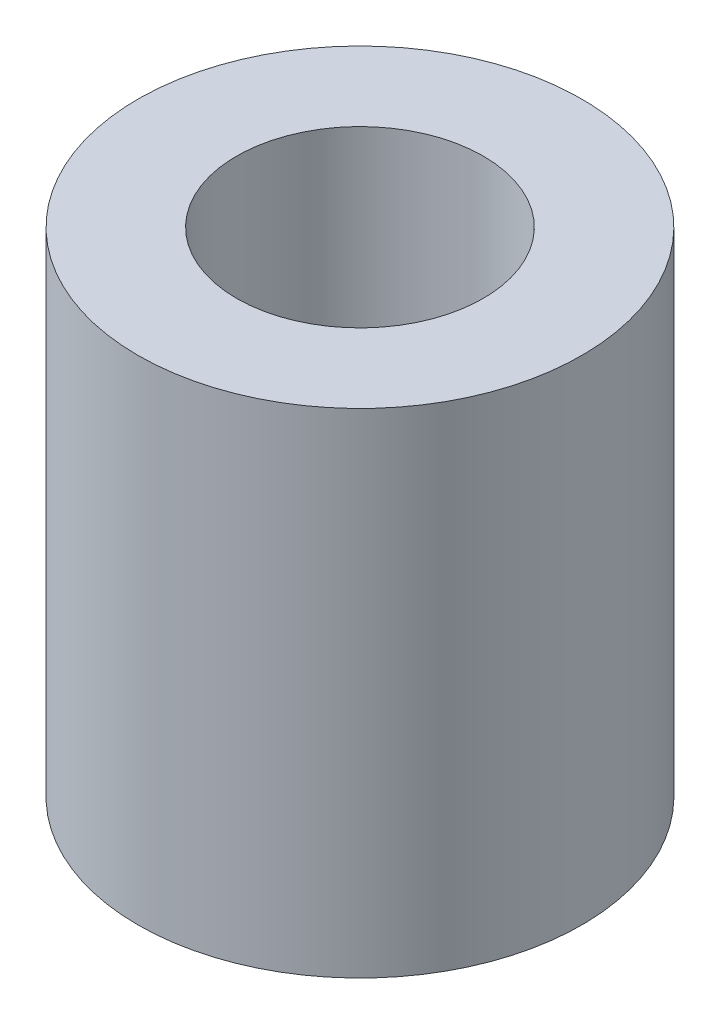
ISO-10303-21;
HEADER;
FILE_DESCRIPTION(('STEP AP214'),'2;1');
FILE_NAME('part.step','',(''),(''),'','','');
FILE_SCHEMA(('AUTOMOTIVE_DESIGN { 1 0 10303 214 1 1 1 1 }'));
ENDSEC;
DATA;
#1=APPLICATION_CONTEXT('core data for automotive mechanical design processes');
#2=APPLICATION_PROTOCOL_DEFINITION('international standard','automotive_design',2000,#1);
#3=PRODUCT_CONTEXT('',#1,'mechanical');
#4=PRODUCT('Part','Part','',(#3));
#5=PRODUCT_RELATED_PRODUCT_CATEGORY('part','',(#4));
#6=PRODUCT_DEFINITION_FORMATION('','',#4);
#7=PRODUCT_DEFINITION_CONTEXT('part definition',#1,'design');
#8=PRODUCT_DEFINITION('design','',#6,#7);
#9=PRODUCT_DEFINITION_SHAPE('','',#8);
#10=(LENGTH_UNIT() NAMED_UNIT(*) SI_UNIT(.MILLI.,.METRE.));
#11=(NAMED_UNIT(*) PLANE_ANGLE_UNIT() SI_UNIT($,.RADIAN.));
#12=(NAMED_UNIT(*) SI_UNIT($,.STERADIAN.) SOLID_ANGLE_UNIT());
#13=UNCERTAINTY_MEASURE_WITH_UNIT(LENGTH_MEASURE(1.E-05),#10,'distance_accuracy_value','');
#14=(GEOMETRIC_REPRESENTATION_CONTEXT(3) GLOBAL_UNCERTAINTY_ASSIGNED_CONTEXT((#13)) GLOBAL_UNIT_ASSIGNED_CONTEXT((#10,
#11,#12)) REPRESENTATION_CONTEXT('',''));
#15=CARTESIAN_POINT('',(0.,0.,0.));
#16=DIRECTION('',(0.,0.,1.));
#17=DIRECTION('',(1.,0.,0.));
#18=AXIS2_PLACEMENT_3D('',#15,#16,#17);
#19=CARTESIAN_POINT('',(0.,5.,0.));
#20=DIRECTION('',(0.,1.,0.));
#21=DIRECTION('',(0.,0.,1.));
#22=AXIS2_PLACEMENT_3D('',#19,#20,#21);
#23=PLANE('',#22);
#24=CARTESIAN_POINT('',(0.,5.,0.));
#25=DIRECTION('',(0.,1.,0.));
#26=DIRECTION('',(0.,0.,1.));
#27=AXIS2_PLACEMENT_3D('',#24,#25,#26);
#28=CIRCLE('',#27,4.5);
#29=CARTESIAN_POINT('',(0.,5.,4.5));
#30=VERTEX_POINT('',#29);
#31=EDGE_CURVE('E10',#30,#30,#28,.T.);
#32=ORIENTED_EDGE('',*,*,#31,.T.);
#33=EDGE_LOOP('',(#32));
#34=FACE_BOUND('',#33,.T.);
#35=CARTESIAN_POINT('',(0.,5.,0.));
#36=DIRECTION('',(0.,1.,0.));
#37=DIRECTION('',(0.,0.,1.));
#38=AXIS2_PLACEMENT_3D('',#35,#36,#37);
#39=CIRCLE('',#38,2.5);
#40=CARTESIAN_POINT('',(0.,5.,2.5));
#41=VERTEX_POINT('',#40);
#42=EDGE_CURVE('E45',#41,#41,#39,.T.);
#43=ORIENTED_EDGE('',*,*,#42,.F.);
#44=EDGE_LOOP('',(#43));
#45=FACE_BOUND('',#44,.T.);
#46=ADVANCED_FACE('F34',(#34,#45),#23,.T.);
#47=CARTESIAN_POINT('',(0.,-5.,0.));
#48=DIRECTION('',(0.,1.,0.));
#49=DIRECTION('',(0.,0.,1.));
#50=AXIS2_PLACEMENT_3D('',#47,#48,#49);
#51=PLANE('',#50);
#52=CARTESIAN_POINT('',(0.,-5.,0.));
#53=DIRECTION('',(0.,1.,0.));
#54=DIRECTION('',(0.,0.,1.));
#55=AXIS2_PLACEMENT_3D('',#52,#53,#54);
#56=CIRCLE('',#55,4.5);
#57=CARTESIAN_POINT('',(0.,-5.,4.5));
#58=VERTEX_POINT('',#57);
#59=EDGE_CURVE('E38',#58,#58,#56,.T.);
#60=ORIENTED_EDGE('',*,*,#59,.F.);
#61=EDGE_LOOP('',(#60));
#62=FACE_BOUND('',#61,.T.);
#63=CARTESIAN_POINT('',(0.,-5.,0.));
#64=DIRECTION('',(0.,1.,0.));
#65=DIRECTION('',(0.,0.,1.));
#66=AXIS2_PLACEMENT_3D('',#63,#64,#65);
#67=CIRCLE('',#66,2.5);
#68=CARTESIAN_POINT('',(0.,-5.,2.5));
#69=VERTEX_POINT('',#68);
#70=EDGE_CURVE('E47',#69,#69,#67,.T.);
#71=ORIENTED_EDGE('',*,*,#70,.T.);
#72=EDGE_LOOP('',(#71));
#73=FACE_BOUND('',#72,.T.);
#74=ADVANCED_FACE('F57',(#62,#73),#51,.F.);
#75=CARTESIAN_POINT('',(0.,5.,0.));
#76=DIRECTION('',(0.,-1.,0.));
#77=DIRECTION('',(0.,0.,-1.));
#78=AXIS2_PLACEMENT_3D('',#75,#76,#77);
#79=CYLINDRICAL_SURFACE('',#78,4.5);
#80=ORIENTED_EDGE('',*,*,#31,.F.);
#81=EDGE_LOOP('',(#80));
#82=FACE_BOUND('',#81,.T.);
#83=ORIENTED_EDGE('',*,*,#59,.T.);
#84=EDGE_LOOP('',(#83));
#85=FACE_BOUND('',#84,.T.);
#86=ADVANCED_FACE('F36',(#82,#85),#79,.T.);
#87=CARTESIAN_POINT('',(0.,5.,0.));
#88=DIRECTION('',(0.,-1.,0.));
#89=DIRECTION('',(0.,0.,-1.));
#90=AXIS2_PLACEMENT_3D('',#87,#88,#89);
#91=CYLINDRICAL_SURFACE('',#90,2.5);
#92=ORIENTED_EDGE('',*,*,#42,.T.);
#93=EDGE_LOOP('',(#92));
#94=FACE_BOUND('',#93,.T.);
#95=ORIENTED_EDGE('',*,*,#70,.F.);
#96=EDGE_LOOP('',(#95));
#97=FACE_BOUND('',#96,.T.);
#98=ADVANCED_FACE('F53',(#94,#97),#91,.F.);
#99=CLOSED_SHELL('',(#46,#74,#86,#98));
#100=MANIFOLD_SOLID_BREP('B2',#99);
#101=ADVANCED_BREP_SHAPE_REPRESENTATION('',(#18,#100),#14);
#102=SHAPE_DEFINITION_REPRESENTATION(#9,#101);
ENDSEC;
END-ISO-10303-21;
